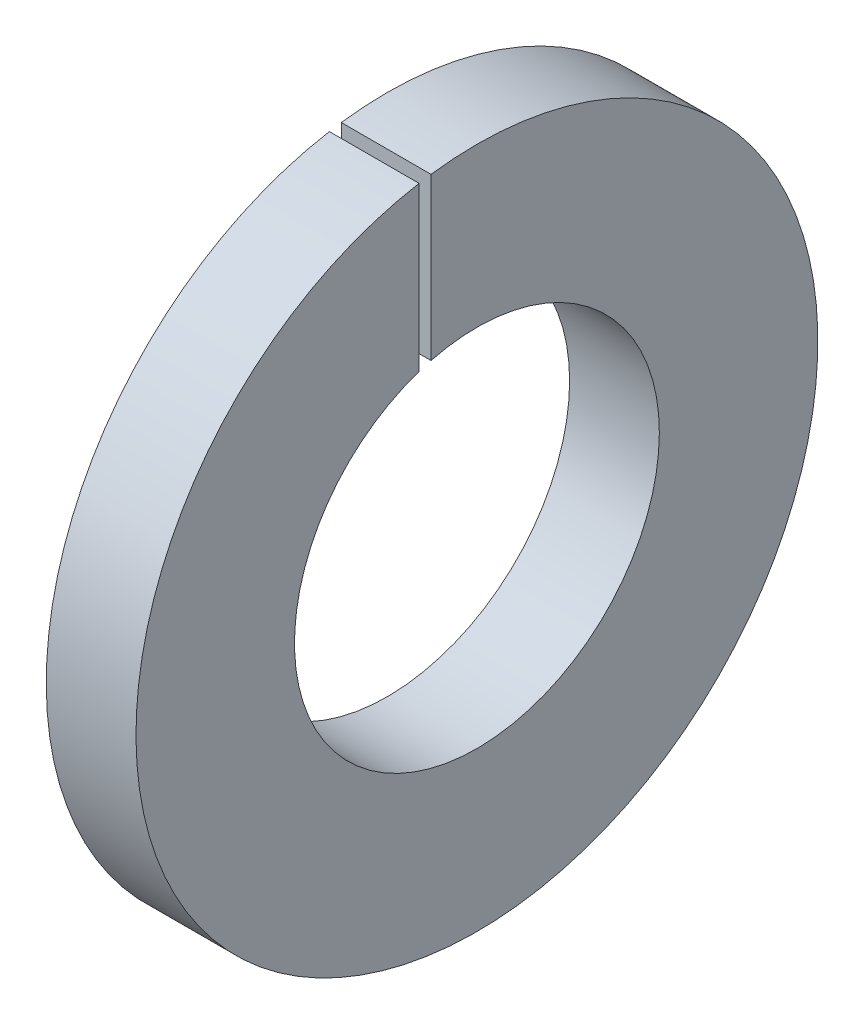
ISO-10303-21;
HEADER;
FILE_DESCRIPTION(('STEP AP214'),'2;1');
FILE_NAME('part.step','',(''),(''),'','','');
FILE_SCHEMA(('AUTOMOTIVE_DESIGN { 1 0 10303 214 1 1 1 1 }'));
ENDSEC;
DATA;
#1=APPLICATION_CONTEXT('core data for automotive mechanical design processes');
#2=APPLICATION_PROTOCOL_DEFINITION('international standard','automotive_design',2000,#1);
#3=PRODUCT_CONTEXT('',#1,'mechanical');
#4=PRODUCT('Part','Part','',(#3));
#5=PRODUCT_RELATED_PRODUCT_CATEGORY('part','',(#4));
#6=PRODUCT_DEFINITION_FORMATION('','',#4);
#7=PRODUCT_DEFINITION_CONTEXT('part definition',#1,'design');
#8=PRODUCT_DEFINITION('design','',#6,#7);
#9=PRODUCT_DEFINITION_SHAPE('','',#8);
#10=(LENGTH_UNIT() NAMED_UNIT(*) SI_UNIT(.MILLI.,.METRE.));
#11=(NAMED_UNIT(*) PLANE_ANGLE_UNIT() SI_UNIT($,.RADIAN.));
#12=(NAMED_UNIT(*) SI_UNIT($,.STERADIAN.) SOLID_ANGLE_UNIT());
#13=UNCERTAINTY_MEASURE_WITH_UNIT(LENGTH_MEASURE(1.E-05),#10,'distance_accuracy_value','');
#14=(GEOMETRIC_REPRESENTATION_CONTEXT(3) GLOBAL_UNCERTAINTY_ASSIGNED_CONTEXT((#13)) GLOBAL_UNIT_ASSIGNED_CONTEXT((#10,
#11,#12)) REPRESENTATION_CONTEXT('',''));
#15=CARTESIAN_POINT('',(0.,0.,0.));
#16=DIRECTION('',(0.,0.,1.));
#17=DIRECTION('',(1.,0.,0.));
#18=AXIS2_PLACEMENT_3D('',#15,#16,#17);
#19=CARTESIAN_POINT('',(0.,3.05,0.));
#20=DIRECTION('',(1.,0.,0.));
#21=DIRECTION('',(0.,0.,-1.));
#22=AXIS2_PLACEMENT_3D('',#19,#20,#21);
#23=PLANE('',#22);
#24=CARTESIAN_POINT('',(0.,0.,0.));
#25=DIRECTION('',(-1.,0.,0.));
#26=DIRECTION('',(0.,0.,1.));
#27=AXIS2_PLACEMENT_3D('',#24,#25,#26);
#28=CIRCLE('',#27,3.05);
#29=CARTESIAN_POINT('',(0.,2.95198061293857,0.767013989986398));
#30=VERTEX_POINT('',#29);
#31=CARTESIAN_POINT('',(0.,2.89264307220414,0.967013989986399));
#32=VERTEX_POINT('',#31);
#33=EDGE_CURVE('E94',#30,#32,#28,.T.);
#34=ORIENTED_EDGE('',*,*,#33,.F.);
#35=DIRECTION('',(0.,1.,0.));
#36=VECTOR('',#35,1.);
#37=CARTESIAN_POINT('',(0.,5.64815806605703,0.767013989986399));
#38=LINE('',#37,#36);
#39=CARTESIAN_POINT('',(0.,5.64815806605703,0.767013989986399));
#40=VERTEX_POINT('',#39);
#41=EDGE_CURVE('E49',#30,#40,#38,.T.);
#42=ORIENTED_EDGE('',*,*,#41,.T.);
#43=CARTESIAN_POINT('',(0.,0.,0.));
#44=DIRECTION('',(-1.,0.,0.));
#45=DIRECTION('',(0.,0.,1.));
#46=AXIS2_PLACEMENT_3D('',#43,#44,#45);
#47=CIRCLE('',#46,5.7);
#48=CARTESIAN_POINT('',(0.,5.61737340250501,0.967013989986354));
#49=VERTEX_POINT('',#48);
#50=EDGE_CURVE('E11',#40,#49,#47,.T.);
#51=ORIENTED_EDGE('',*,*,#50,.T.);
#52=DIRECTION('',(0.,-1.,0.));
#53=VECTOR('',#52,1.);
#54=CARTESIAN_POINT('',(0.,5.61737340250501,0.967013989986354));
#55=LINE('',#54,#53);
#56=EDGE_CURVE('E76',#49,#32,#55,.T.);
#57=ORIENTED_EDGE('',*,*,#56,.T.);
#58=EDGE_LOOP('',(#34,#42,#51,#57));
#59=FACE_BOUND('',#58,.T.);
#60=ADVANCED_FACE('F35',(#59),#23,.F.);
#61=CARTESIAN_POINT('',(-42.8552601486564,0.,0.));
#62=DIRECTION('',(-1.,0.,0.));
#63=DIRECTION('',(0.,0.,1.));
#64=AXIS2_PLACEMENT_3D('',#61,#62,#63);
#65=CYLINDRICAL_SURFACE('',#64,5.7);
#66=ORIENTED_EDGE('',*,*,#50,.F.);
#67=DIRECTION('',(1.,0.,0.));
#68=VECTOR('',#67,1.);
#69=CARTESIAN_POINT('',(0.,5.64815806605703,0.767013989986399));
#70=LINE('',#69,#68);
#71=CARTESIAN_POINT('',(1.5,5.64815806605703,0.767013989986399));
#72=VERTEX_POINT('',#71);
#73=EDGE_CURVE('E93',#40,#72,#70,.T.);
#74=ORIENTED_EDGE('',*,*,#73,.T.);
#75=CARTESIAN_POINT('',(1.5,0.,0.));
#76=DIRECTION('',(-1.,0.,0.));
#77=DIRECTION('',(0.,0.,1.));
#78=AXIS2_PLACEMENT_3D('',#75,#76,#77);
#79=CIRCLE('',#78,5.7);
#80=CARTESIAN_POINT('',(1.5,5.61737340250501,0.967013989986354));
#81=VERTEX_POINT('',#80);
#82=EDGE_CURVE('E42',#72,#81,#79,.T.);
#83=ORIENTED_EDGE('',*,*,#82,.T.);
#84=DIRECTION('',(1.,0.,0.));
#85=VECTOR('',#84,1.);
#86=CARTESIAN_POINT('',(0.,5.61737340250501,0.967013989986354));
#87=LINE('',#86,#85);
#88=EDGE_CURVE('E73',#49,#81,#87,.T.);
#89=ORIENTED_EDGE('',*,*,#88,.F.);
#90=EDGE_LOOP('',(#66,#74,#83,#89));
#91=FACE_BOUND('',#90,.T.);
#92=ADVANCED_FACE('F92',(#91),#65,.T.);
#93=CARTESIAN_POINT('',(1.5,3.05,0.));
#94=DIRECTION('',(-1.,0.,0.));
#95=DIRECTION('',(0.,0.,1.));
#96=AXIS2_PLACEMENT_3D('',#93,#94,#95);
#97=PLANE('',#96);
#98=ORIENTED_EDGE('',*,*,#82,.F.);
#99=DIRECTION('',(0.,1.,0.));
#100=VECTOR('',#99,1.);
#101=CARTESIAN_POINT('',(1.5,5.64815806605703,0.767013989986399));
#102=LINE('',#101,#100);
#103=CARTESIAN_POINT('',(1.5,2.95198061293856,0.767013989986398));
#104=VERTEX_POINT('',#103);
#105=EDGE_CURVE('E89',#104,#72,#102,.T.);
#106=ORIENTED_EDGE('',*,*,#105,.F.);
#107=CARTESIAN_POINT('',(1.5,0.,0.));
#108=DIRECTION('',(-1.,0.,0.));
#109=DIRECTION('',(0.,0.,1.));
#110=AXIS2_PLACEMENT_3D('',#107,#108,#109);
#111=CIRCLE('',#110,3.05);
#112=CARTESIAN_POINT('',(1.5,2.89264307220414,0.967013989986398));
#113=VERTEX_POINT('',#112);
#114=EDGE_CURVE('E88',#104,#113,#111,.T.);
#115=ORIENTED_EDGE('',*,*,#114,.T.);
#116=DIRECTION('',(0.,-1.,0.));
#117=VECTOR('',#116,1.);
#118=CARTESIAN_POINT('',(1.5,5.61737340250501,0.967013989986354));
#119=LINE('',#118,#117);
#120=EDGE_CURVE('E57',#81,#113,#119,.T.);
#121=ORIENTED_EDGE('',*,*,#120,.F.);
#122=EDGE_LOOP('',(#98,#106,#115,#121));
#123=FACE_BOUND('',#122,.T.);
#124=ADVANCED_FACE('F85',(#123),#97,.F.);
#125=CARTESIAN_POINT('',(-42.8552601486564,0.,0.));
#126=DIRECTION('',(-1.,0.,0.));
#127=DIRECTION('',(0.,0.,1.));
#128=AXIS2_PLACEMENT_3D('',#125,#126,#127);
#129=CYLINDRICAL_SURFACE('',#128,3.05);
#130=ORIENTED_EDGE('',*,*,#114,.F.);
#131=DIRECTION('',(1.,0.,0.));
#132=VECTOR('',#131,1.);
#133=CARTESIAN_POINT('',(0.,2.95198061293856,0.767013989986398));
#134=LINE('',#133,#132);
#135=EDGE_CURVE('E100',#30,#104,#134,.T.);
#136=ORIENTED_EDGE('',*,*,#135,.F.);
#137=ORIENTED_EDGE('',*,*,#33,.T.);
#138=DIRECTION('',(1.,0.,0.));
#139=VECTOR('',#138,1.);
#140=CARTESIAN_POINT('',(0.,2.89264307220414,0.967013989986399));
#141=LINE('',#140,#139);
#142=EDGE_CURVE('E80',#32,#113,#141,.T.);
#143=ORIENTED_EDGE('',*,*,#142,.T.);
#144=EDGE_LOOP('',(#130,#136,#137,#143));
#145=FACE_BOUND('',#144,.T.);
#146=ADVANCED_FACE('F107',(#145),#129,.F.);
#147=CARTESIAN_POINT('',(0.,5.61737340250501,0.967013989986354));
#148=DIRECTION('',(0.,0.,1.));
#149=DIRECTION('',(0.,-1.,0.));
#150=AXIS2_PLACEMENT_3D('',#147,#148,#149);
#151=PLANE('',#150);
#152=ORIENTED_EDGE('',*,*,#120,.T.);
#153=ORIENTED_EDGE('',*,*,#142,.F.);
#154=ORIENTED_EDGE('',*,*,#56,.F.);
#155=ORIENTED_EDGE('',*,*,#88,.T.);
#156=EDGE_LOOP('',(#152,#153,#154,#155));
#157=FACE_BOUND('',#156,.T.);
#158=ADVANCED_FACE('F74',(#157),#151,.F.);
#159=CARTESIAN_POINT('',(0.,5.64815806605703,0.767013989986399));
#160=DIRECTION('',(0.,0.,-1.));
#161=DIRECTION('',(0.,1.,0.));
#162=AXIS2_PLACEMENT_3D('',#159,#160,#161);
#163=PLANE('',#162);
#164=ORIENTED_EDGE('',*,*,#105,.T.);
#165=ORIENTED_EDGE('',*,*,#73,.F.);
#166=ORIENTED_EDGE('',*,*,#41,.F.);
#167=ORIENTED_EDGE('',*,*,#135,.T.);
#168=EDGE_LOOP('',(#164,#165,#166,#167));
#169=FACE_BOUND('',#168,.T.);
#170=ADVANCED_FACE('F105',(#169),#163,.F.);
#171=CLOSED_SHELL('',(#60,#92,#124,#146,#158,#170));
#172=MANIFOLD_SOLID_BREP('B2',#171);
#173=ADVANCED_BREP_SHAPE_REPRESENTATION('',(#18,#172),#14);
#174=SHAPE_DEFINITION_REPRESENTATION(#9,#173);
ENDSEC;
END-ISO-10303-21;
